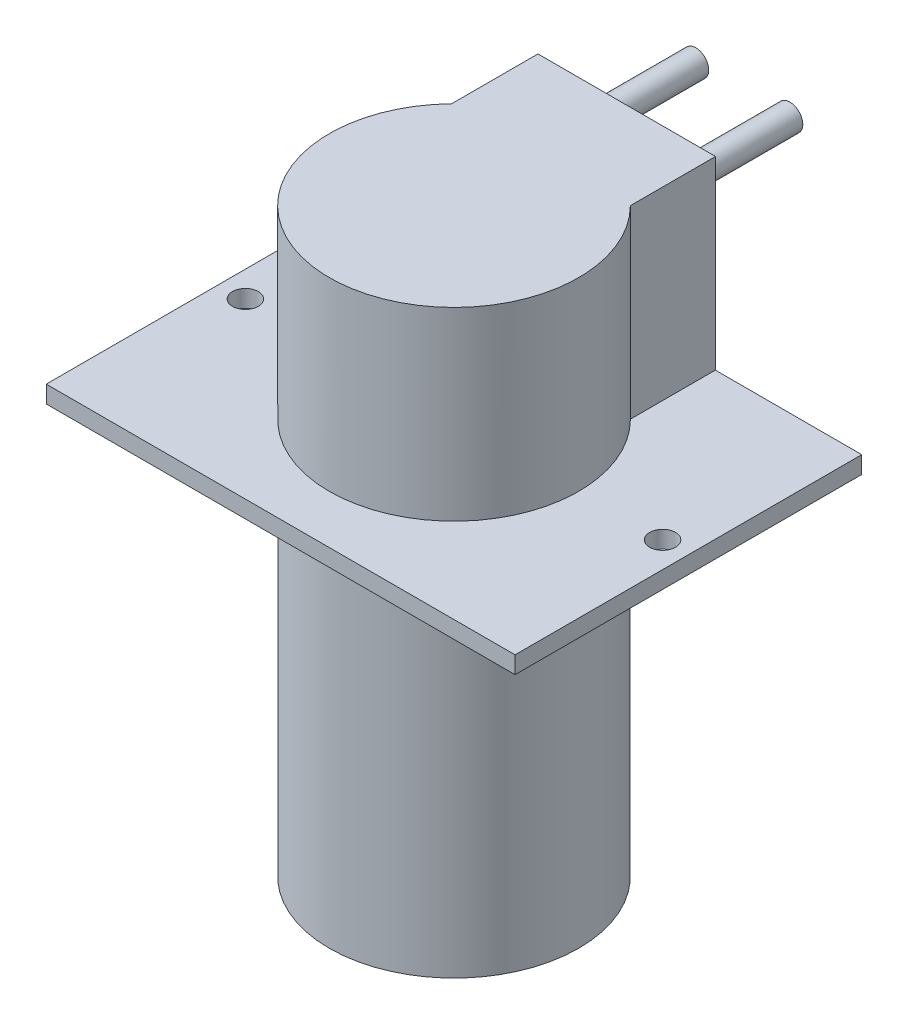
from build123d import *

# Parameters (mm, degrees)
SKETCH_1_R          = 14.5
EXTRUDE_1_DEPTH     = 44
SKETCH_2_W          = 54.5
SKETCH_2_H          = 40.3
EXTRUDE_2_DEPTH     = 2
SKETCH_3_R          = 14.5
EXTRUDE_3_DEPTH     = 21.522526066
SKETCH_4_R          = 1.5
CUT_EXTRUDE_1_DEPTH = 23.5
SKETCH_5_W          = 20.647019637
SKETCH_5_H          = 10.038353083
EXTRUDE_4_DEPTH     = 21.5
SKETCH_6_R          = 1.5
EXTRUDE_5_DEPTH     = 13.5


with BuildPart() as part:
    # Sketch 1 → Extrude 1 (new body)
    with BuildSketch(Plane(origin=(0, 0, 0), x_dir=(1, 0, 0), z_dir=(0, 1, 0))):
        with Locations(Location((0, 0, 0), (0, 0, 270))):
            Circle(SKETCH_1_R)
    extrude(amount=EXTRUDE_1_DEPTH)

    # Sketch 2 → Extrude 2 (add)
    with BuildSketch(Plane(origin=(0, 44, 0), x_dir=(1, 0, 0), z_dir=(0, 1, 0))):
        Rectangle(SKETCH_2_W, SKETCH_2_H)
    extrude(amount=EXTRUDE_2_DEPTH)

    # Sketch 3 → Extrude 3 (add)
    with BuildSketch(Plane(origin=(0, 46, 0), x_dir=(1, 0, 0), z_dir=(0, 1, 0))):
        with Locations(Location((0, 0, 0), (0, 0, 270))):
            Circle(SKETCH_3_R)
    extrude(amount=EXTRUDE_3_DEPTH)

    # Sketch 4 → Cut-Extrude 1 (cut)
    with BuildSketch(Plane(origin=(0, 46, 0), x_dir=(1, 0, 0), z_dir=(0, 1, 0))):
        with Locations(Location((-24.25, 0, 0), (0, 0, 270))):
            Circle(SKETCH_4_R)
        with Locations(Location((24.25, 0, 0), (0, 0, 270))):
            Circle(SKETCH_4_R)
    extrude(amount=-CUT_EXTRUDE_1_DEPTH, mode=Mode.SUBTRACT)

    # Sketch 5 → Extrude 4 (add)
    with BuildSketch(Plane(origin=(0, 67.522526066, 0), x_dir=(1, 0, 0), z_dir=(0, 1, 0))):
        with Locations((-0.069016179, 15.130823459)):
            Rectangle(SKETCH_5_W, SKETCH_5_H)
    extrude(amount=-EXTRUDE_4_DEPTH)

    # Sketch 6 → Extrude 5 (add)
    with BuildSketch(Plane(origin=(0, 0, -20.15), x_dir=(-1, 0, 0), z_dir=(0, 0, -1))):
        with Locations((-5.397131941, 62.321403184)):
            Circle(SKETCH_6_R)
        with Locations((5.535519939, 62.321403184)):
            Circle(SKETCH_6_R)
    extrude(amount=EXTRUDE_5_DEPTH)


solid = part.part
